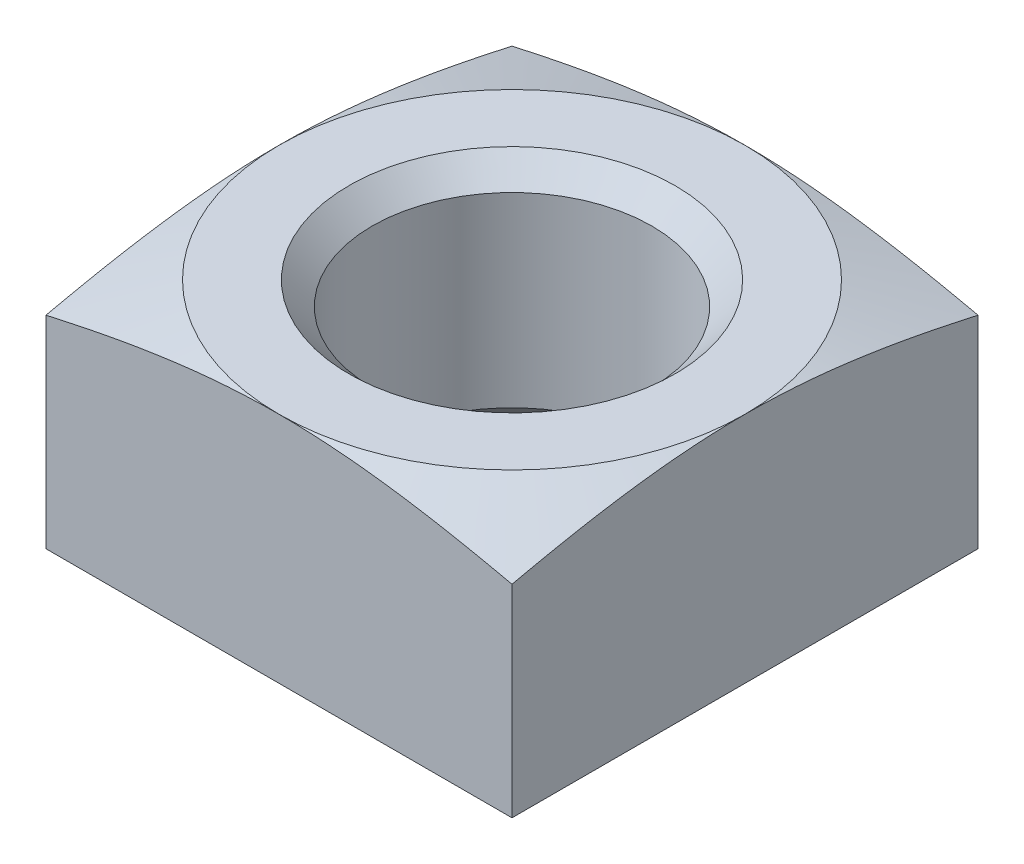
from build123d import *

# Parameters (mm, degrees)
SKETCH8_W           = 10
SKETCH8_H           = 5
BOSS_EXTRUDE2_DEPTH = 5
SKETCH11_R          = 3
CUT_EXTRUDE1_DEPTH  = 5
CHAMFER1_SIZE       = 0.5


with BuildPart() as part:
    # Sketch8 → Boss-Extrude2 (new, symmetric)
    with BuildSketch(Plane(origin=(0, 0, 0), x_dir=(0, 0, -1), z_dir=(1, 0, 0))):
        Rectangle(SKETCH8_W, SKETCH8_H)
    extrude(amount=BOSS_EXTRUDE2_DEPTH, both=True)

    # Sketch10 → Cut-Revolve1 (revolve, cut)
    with BuildSketch(Plane(origin=(0, 0, 0), x_dir=(0, 0, -1), z_dir=(1, 0, 0))):
        Polygon((-5, 2.5), (-7.2, 2.5), (-7.2, 1.8), align=None)
    revolve(axis=Axis((0, 59.838437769, 0), (0, -1, 0)), mode=Mode.SUBTRACT)

    # Sketch11 → Cut-Extrude1 (cut)
    with BuildSketch(Plane(origin=(0, 2.5, 0), x_dir=(1, 0, 0), z_dir=(0, 1, 0))):
        with Locations(Location((0, 0, 0), (0, 0, 270))):
            Circle(SKETCH11_R)
    extrude(amount=-CUT_EXTRUDE1_DEPTH, mode=Mode.SUBTRACT)

    # Chamfer1
    chamfer1_edges = [part.edges().sort_by_distance(p)[0] for p in [
        (0, 2.5, -3),
        (0, -2.5, -3),
    ]]
    chamfer(chamfer1_edges, length=CHAMFER1_SIZE)


solid = part.part
